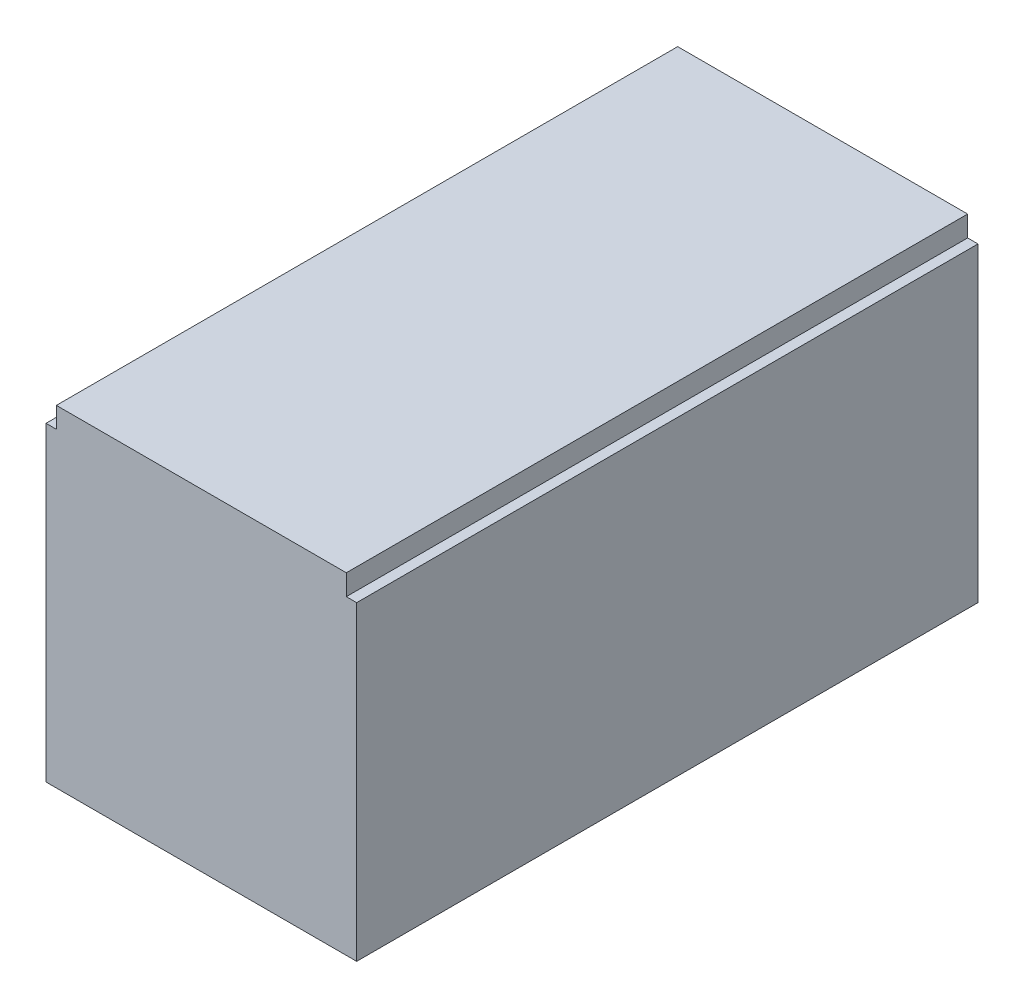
ISO-10303-21;
HEADER;
FILE_DESCRIPTION(('STEP AP214'),'2;1');
FILE_NAME('part.step','',(''),(''),'','','');
FILE_SCHEMA(('AUTOMOTIVE_DESIGN { 1 0 10303 214 1 1 1 1 }'));
ENDSEC;
DATA;
#1=APPLICATION_CONTEXT('core data for automotive mechanical design processes');
#2=APPLICATION_PROTOCOL_DEFINITION('international standard','automotive_design',2000,#1);
#3=PRODUCT_CONTEXT('',#1,'mechanical');
#4=PRODUCT('Part','Part','',(#3));
#5=PRODUCT_RELATED_PRODUCT_CATEGORY('part','',(#4));
#6=PRODUCT_DEFINITION_FORMATION('','',#4);
#7=PRODUCT_DEFINITION_CONTEXT('part definition',#1,'design');
#8=PRODUCT_DEFINITION('design','',#6,#7);
#9=PRODUCT_DEFINITION_SHAPE('','',#8);
#10=(LENGTH_UNIT() NAMED_UNIT(*) SI_UNIT(.MILLI.,.METRE.));
#11=(NAMED_UNIT(*) PLANE_ANGLE_UNIT() SI_UNIT($,.RADIAN.));
#12=(NAMED_UNIT(*) SI_UNIT($,.STERADIAN.) SOLID_ANGLE_UNIT());
#13=UNCERTAINTY_MEASURE_WITH_UNIT(LENGTH_MEASURE(1.E-05),#10,'distance_accuracy_value','');
#14=(GEOMETRIC_REPRESENTATION_CONTEXT(3) GLOBAL_UNCERTAINTY_ASSIGNED_CONTEXT((#13)) GLOBAL_UNIT_ASSIGNED_CONTEXT((#10,
#11,#12)) REPRESENTATION_CONTEXT('',''));
#15=CARTESIAN_POINT('',(0.,0.,0.));
#16=DIRECTION('',(0.,0.,1.));
#17=DIRECTION('',(1.,0.,0.));
#18=AXIS2_PLACEMENT_3D('',#15,#16,#17);
#19=CARTESIAN_POINT('',(-3.75,8.,-15.));
#20=DIRECTION('',(1.,0.,0.));
#21=DIRECTION('',(0.,0.,-1.));
#22=AXIS2_PLACEMENT_3D('',#19,#20,#21);
#23=PLANE('',#22);
#24=DIRECTION('',(0.,-1.,0.));
#25=VECTOR('',#24,1.);
#26=CARTESIAN_POINT('',(-3.75,8.,0.));
#27=LINE('',#26,#25);
#28=CARTESIAN_POINT('',(-3.75,7.5,0.));
#29=VERTEX_POINT('',#28);
#30=CARTESIAN_POINT('',(-3.75,0.,0.));
#31=VERTEX_POINT('',#30);
#32=EDGE_CURVE('E11',#29,#31,#27,.T.);
#33=ORIENTED_EDGE('',*,*,#32,.F.);
#34=DIRECTION('',(0.,0.,1.));
#35=VECTOR('',#34,1.);
#36=CARTESIAN_POINT('',(-3.75,7.5,0.));
#37=LINE('',#36,#35);
#38=CARTESIAN_POINT('',(-3.75,7.5,-15.));
#39=VERTEX_POINT('',#38);
#40=EDGE_CURVE('E144',#39,#29,#37,.T.);
#41=ORIENTED_EDGE('',*,*,#40,.F.);
#42=DIRECTION('',(0.,-1.,0.));
#43=VECTOR('',#42,1.);
#44=CARTESIAN_POINT('',(-3.75,8.,-15.));
#45=LINE('',#44,#43);
#46=CARTESIAN_POINT('',(-3.75,0.,-15.));
#47=VERTEX_POINT('',#46);
#48=EDGE_CURVE('E119',#39,#47,#45,.T.);
#49=ORIENTED_EDGE('',*,*,#48,.T.);
#50=DIRECTION('',(0.,0.,1.));
#51=VECTOR('',#50,1.);
#52=CARTESIAN_POINT('',(-3.75,0.,-15.));
#53=LINE('',#52,#51);
#54=EDGE_CURVE('E131',#47,#31,#53,.T.);
#55=ORIENTED_EDGE('',*,*,#54,.T.);
#56=EDGE_LOOP('',(#33,#41,#49,#55));
#57=FACE_BOUND('',#56,.T.);
#58=ADVANCED_FACE('F31',(#57),#23,.F.);
#59=CARTESIAN_POINT('',(-3.75,8.,0.));
#60=DIRECTION('',(0.,0.,-1.));
#61=DIRECTION('',(-1.,0.,0.));
#62=AXIS2_PLACEMENT_3D('',#59,#60,#61);
#63=PLANE('',#62);
#64=DIRECTION('',(1.,0.,0.));
#65=VECTOR('',#64,1.);
#66=CARTESIAN_POINT('',(3.75,7.5,0.));
#67=LINE('',#66,#65);
#68=CARTESIAN_POINT('',(3.5,7.5,0.));
#69=VERTEX_POINT('',#68);
#70=CARTESIAN_POINT('',(3.75,7.5,0.));
#71=VERTEX_POINT('',#70);
#72=EDGE_CURVE('E96',#69,#71,#67,.T.);
#73=ORIENTED_EDGE('',*,*,#72,.F.);
#74=DIRECTION('',(0.,1.,0.));
#75=VECTOR('',#74,1.);
#76=CARTESIAN_POINT('',(3.5,7.5,0.));
#77=LINE('',#76,#75);
#78=CARTESIAN_POINT('',(3.5,8.,0.));
#79=VERTEX_POINT('',#78);
#80=EDGE_CURVE('E145',#69,#79,#77,.T.);
#81=ORIENTED_EDGE('',*,*,#80,.T.);
#82=DIRECTION('',(1.,0.,0.));
#83=VECTOR('',#82,1.);
#84=CARTESIAN_POINT('',(-3.75,8.,0.));
#85=LINE('',#84,#83);
#86=CARTESIAN_POINT('',(-3.5,8.,0.));
#87=VERTEX_POINT('',#86);
#88=EDGE_CURVE('E127',#87,#79,#85,.T.);
#89=ORIENTED_EDGE('',*,*,#88,.F.);
#90=DIRECTION('',(0.,1.,0.));
#91=VECTOR('',#90,1.);
#92=CARTESIAN_POINT('',(-3.5,7.5,0.));
#93=LINE('',#92,#91);
#94=CARTESIAN_POINT('',(-3.5,7.5,0.));
#95=VERTEX_POINT('',#94);
#96=EDGE_CURVE('E53',#95,#87,#93,.T.);
#97=ORIENTED_EDGE('',*,*,#96,.F.);
#98=DIRECTION('',(1.,0.,0.));
#99=VECTOR('',#98,1.);
#100=CARTESIAN_POINT('',(-3.75,7.5,0.));
#101=LINE('',#100,#99);
#102=EDGE_CURVE('E150',#29,#95,#101,.T.);
#103=ORIENTED_EDGE('',*,*,#102,.F.);
#104=ORIENTED_EDGE('',*,*,#32,.T.);
#105=DIRECTION('',(1.,0.,0.));
#106=VECTOR('',#105,1.);
#107=CARTESIAN_POINT('',(-3.75,0.,0.));
#108=LINE('',#107,#106);
#109=CARTESIAN_POINT('',(3.75,0.,0.));
#110=VERTEX_POINT('',#109);
#111=EDGE_CURVE('E117',#31,#110,#108,.T.);
#112=ORIENTED_EDGE('',*,*,#111,.T.);
#113=DIRECTION('',(0.,-1.,0.));
#114=VECTOR('',#113,1.);
#115=CARTESIAN_POINT('',(3.75,8.,0.));
#116=LINE('',#115,#114);
#117=EDGE_CURVE('E38',#71,#110,#116,.T.);
#118=ORIENTED_EDGE('',*,*,#117,.F.);
#119=EDGE_LOOP('',(#73,#81,#89,#97,#103,#104,#112,#118));
#120=FACE_BOUND('',#119,.T.);
#121=ADVANCED_FACE('F115',(#120),#63,.F.);
#122=CARTESIAN_POINT('',(3.75,8.,-15.));
#123=DIRECTION('',(-1.,0.,0.));
#124=DIRECTION('',(0.,0.,1.));
#125=AXIS2_PLACEMENT_3D('',#122,#123,#124);
#126=PLANE('',#125);
#127=DIRECTION('',(0.,-1.,0.));
#128=VECTOR('',#127,1.);
#129=CARTESIAN_POINT('',(3.75,8.,-15.));
#130=LINE('',#129,#128);
#131=CARTESIAN_POINT('',(3.75,7.5,-15.));
#132=VERTEX_POINT('',#131);
#133=CARTESIAN_POINT('',(3.75,0.,-15.));
#134=VERTEX_POINT('',#133);
#135=EDGE_CURVE('E112',#132,#134,#130,.T.);
#136=ORIENTED_EDGE('',*,*,#135,.F.);
#137=DIRECTION('',(0.,0.,-1.));
#138=VECTOR('',#137,1.);
#139=CARTESIAN_POINT('',(3.75,7.5,0.));
#140=LINE('',#139,#138);
#141=EDGE_CURVE('E99',#71,#132,#140,.T.);
#142=ORIENTED_EDGE('',*,*,#141,.F.);
#143=ORIENTED_EDGE('',*,*,#117,.T.);
#144=DIRECTION('',(0.,0.,-1.));
#145=VECTOR('',#144,1.);
#146=CARTESIAN_POINT('',(3.75,0.,-15.));
#147=LINE('',#146,#145);
#148=EDGE_CURVE('E128',#110,#134,#147,.T.);
#149=ORIENTED_EDGE('',*,*,#148,.T.);
#150=EDGE_LOOP('',(#136,#142,#143,#149));
#151=FACE_BOUND('',#150,.T.);
#152=ADVANCED_FACE('F109',(#151),#126,.F.);
#153=CARTESIAN_POINT('',(-3.75,8.,-15.));
#154=DIRECTION('',(0.,0.,1.));
#155=DIRECTION('',(1.,0.,0.));
#156=AXIS2_PLACEMENT_3D('',#153,#154,#155);
#157=PLANE('',#156);
#158=DIRECTION('',(-1.,0.,0.));
#159=VECTOR('',#158,1.);
#160=CARTESIAN_POINT('',(-3.75,8.,-15.));
#161=LINE('',#160,#159);
#162=CARTESIAN_POINT('',(3.5,8.,-15.));
#163=VERTEX_POINT('',#162);
#164=CARTESIAN_POINT('',(-3.5,8.,-15.));
#165=VERTEX_POINT('',#164);
#166=EDGE_CURVE('E123',#163,#165,#161,.T.);
#167=ORIENTED_EDGE('',*,*,#166,.F.);
#168=DIRECTION('',(0.,1.,0.));
#169=VECTOR('',#168,1.);
#170=CARTESIAN_POINT('',(3.5,7.5,-15.));
#171=LINE('',#170,#169);
#172=CARTESIAN_POINT('',(3.5,7.5,-15.));
#173=VERTEX_POINT('',#172);
#174=EDGE_CURVE('E45',#173,#163,#171,.T.);
#175=ORIENTED_EDGE('',*,*,#174,.F.);
#176=DIRECTION('',(-1.,0.,0.));
#177=VECTOR('',#176,1.);
#178=CARTESIAN_POINT('',(3.75,7.5,-15.));
#179=LINE('',#178,#177);
#180=EDGE_CURVE('E113',#132,#173,#179,.T.);
#181=ORIENTED_EDGE('',*,*,#180,.F.);
#182=ORIENTED_EDGE('',*,*,#135,.T.);
#183=DIRECTION('',(-1.,0.,0.));
#184=VECTOR('',#183,1.);
#185=CARTESIAN_POINT('',(-3.75,0.,-15.));
#186=LINE('',#185,#184);
#187=EDGE_CURVE('E124',#134,#47,#186,.T.);
#188=ORIENTED_EDGE('',*,*,#187,.T.);
#189=ORIENTED_EDGE('',*,*,#48,.F.);
#190=DIRECTION('',(-1.,0.,0.));
#191=VECTOR('',#190,1.);
#192=CARTESIAN_POINT('',(-3.75,7.5,-15.));
#193=LINE('',#192,#191);
#194=CARTESIAN_POINT('',(-3.5,7.5,-15.));
#195=VERTEX_POINT('',#194);
#196=EDGE_CURVE('E139',#195,#39,#193,.T.);
#197=ORIENTED_EDGE('',*,*,#196,.F.);
#198=DIRECTION('',(0.,1.,0.));
#199=VECTOR('',#198,1.);
#200=CARTESIAN_POINT('',(-3.5,7.5,-15.));
#201=LINE('',#200,#199);
#202=EDGE_CURVE('E134',#195,#165,#201,.T.);
#203=ORIENTED_EDGE('',*,*,#202,.T.);
#204=EDGE_LOOP('',(#167,#175,#181,#182,#188,#189,#197,#203));
#205=FACE_BOUND('',#204,.T.);
#206=ADVANCED_FACE('F161',(#205),#157,.F.);
#207=CARTESIAN_POINT('',(-3.75,8.,0.));
#208=DIRECTION('',(0.,1.,0.));
#209=DIRECTION('',(0.,0.,1.));
#210=AXIS2_PLACEMENT_3D('',#207,#208,#209);
#211=PLANE('',#210);
#212=DIRECTION('',(0.,0.,1.));
#213=VECTOR('',#212,1.);
#214=CARTESIAN_POINT('',(3.5,8.,0.));
#215=LINE('',#214,#213);
#216=EDGE_CURVE('E105',#163,#79,#215,.T.);
#217=ORIENTED_EDGE('',*,*,#216,.F.);
#218=ORIENTED_EDGE('',*,*,#166,.T.);
#219=DIRECTION('',(0.,0.,-1.));
#220=VECTOR('',#219,1.);
#221=CARTESIAN_POINT('',(-3.5,8.,0.));
#222=LINE('',#221,#220);
#223=EDGE_CURVE('E142',#87,#165,#222,.T.);
#224=ORIENTED_EDGE('',*,*,#223,.F.);
#225=ORIENTED_EDGE('',*,*,#88,.T.);
#226=EDGE_LOOP('',(#217,#218,#224,#225));
#227=FACE_BOUND('',#226,.T.);
#228=ADVANCED_FACE('F164',(#227),#211,.T.);
#229=CARTESIAN_POINT('',(-3.75,0.,0.));
#230=DIRECTION('',(0.,1.,0.));
#231=DIRECTION('',(0.,0.,1.));
#232=AXIS2_PLACEMENT_3D('',#229,#230,#231);
#233=PLANE('',#232);
#234=ORIENTED_EDGE('',*,*,#54,.F.);
#235=ORIENTED_EDGE('',*,*,#187,.F.);
#236=ORIENTED_EDGE('',*,*,#148,.F.);
#237=ORIENTED_EDGE('',*,*,#111,.F.);
#238=EDGE_LOOP('',(#234,#235,#236,#237));
#239=FACE_BOUND('',#238,.T.);
#240=ADVANCED_FACE('F177',(#239),#233,.F.);
#241=CARTESIAN_POINT('',(-3.5,7.5,0.));
#242=DIRECTION('',(1.,0.,0.));
#243=DIRECTION('',(0.,0.,-1.));
#244=AXIS2_PLACEMENT_3D('',#241,#242,#243);
#245=PLANE('',#244);
#246=ORIENTED_EDGE('',*,*,#223,.T.);
#247=ORIENTED_EDGE('',*,*,#202,.F.);
#248=DIRECTION('',(0.,0.,-1.));
#249=VECTOR('',#248,1.);
#250=CARTESIAN_POINT('',(-3.5,7.5,0.));
#251=LINE('',#250,#249);
#252=EDGE_CURVE('E147',#95,#195,#251,.T.);
#253=ORIENTED_EDGE('',*,*,#252,.F.);
#254=ORIENTED_EDGE('',*,*,#96,.T.);
#255=EDGE_LOOP('',(#246,#247,#253,#254));
#256=FACE_BOUND('',#255,.T.);
#257=ADVANCED_FACE('F166',(#256),#245,.F.);
#258=CARTESIAN_POINT('',(-3.75,7.5,-15.));
#259=DIRECTION('',(0.,-1.,0.));
#260=DIRECTION('',(0.,0.,-1.));
#261=AXIS2_PLACEMENT_3D('',#258,#259,#260);
#262=PLANE('',#261);
#263=ORIENTED_EDGE('',*,*,#40,.T.);
#264=ORIENTED_EDGE('',*,*,#102,.T.);
#265=ORIENTED_EDGE('',*,*,#252,.T.);
#266=ORIENTED_EDGE('',*,*,#196,.T.);
#267=EDGE_LOOP('',(#263,#264,#265,#266));
#268=FACE_BOUND('',#267,.T.);
#269=ADVANCED_FACE('F168',(#268),#262,.F.);
#270=CARTESIAN_POINT('',(3.5,7.5,0.));
#271=DIRECTION('',(-1.,0.,0.));
#272=DIRECTION('',(0.,0.,1.));
#273=AXIS2_PLACEMENT_3D('',#270,#271,#272);
#274=PLANE('',#273);
#275=ORIENTED_EDGE('',*,*,#216,.T.);
#276=ORIENTED_EDGE('',*,*,#80,.F.);
#277=DIRECTION('',(0.,0.,1.));
#278=VECTOR('',#277,1.);
#279=CARTESIAN_POINT('',(3.5,7.5,0.));
#280=LINE('',#279,#278);
#281=EDGE_CURVE('E101',#173,#69,#280,.T.);
#282=ORIENTED_EDGE('',*,*,#281,.F.);
#283=ORIENTED_EDGE('',*,*,#174,.T.);
#284=EDGE_LOOP('',(#275,#276,#282,#283));
#285=FACE_BOUND('',#284,.T.);
#286=ADVANCED_FACE('F159',(#285),#274,.F.);
#287=CARTESIAN_POINT('',(3.5,7.5,0.));
#288=DIRECTION('',(0.,-1.,0.));
#289=DIRECTION('',(0.,0.,-1.));
#290=AXIS2_PLACEMENT_3D('',#287,#288,#289);
#291=PLANE('',#290);
#292=ORIENTED_EDGE('',*,*,#72,.T.);
#293=ORIENTED_EDGE('',*,*,#141,.T.);
#294=ORIENTED_EDGE('',*,*,#180,.T.);
#295=ORIENTED_EDGE('',*,*,#281,.T.);
#296=EDGE_LOOP('',(#292,#293,#294,#295));
#297=FACE_BOUND('',#296,.T.);
#298=ADVANCED_FACE('F98',(#297),#291,.F.);
#299=CLOSED_SHELL('',(#58,#121,#152,#206,#228,#240,#257,#269,#286,#298));
#300=MANIFOLD_SOLID_BREP('B2',#299);
#301=ADVANCED_BREP_SHAPE_REPRESENTATION('',(#18,#300),#14);
#302=SHAPE_DEFINITION_REPRESENTATION(#9,#301);
ENDSEC;
END-ISO-10303-21;
